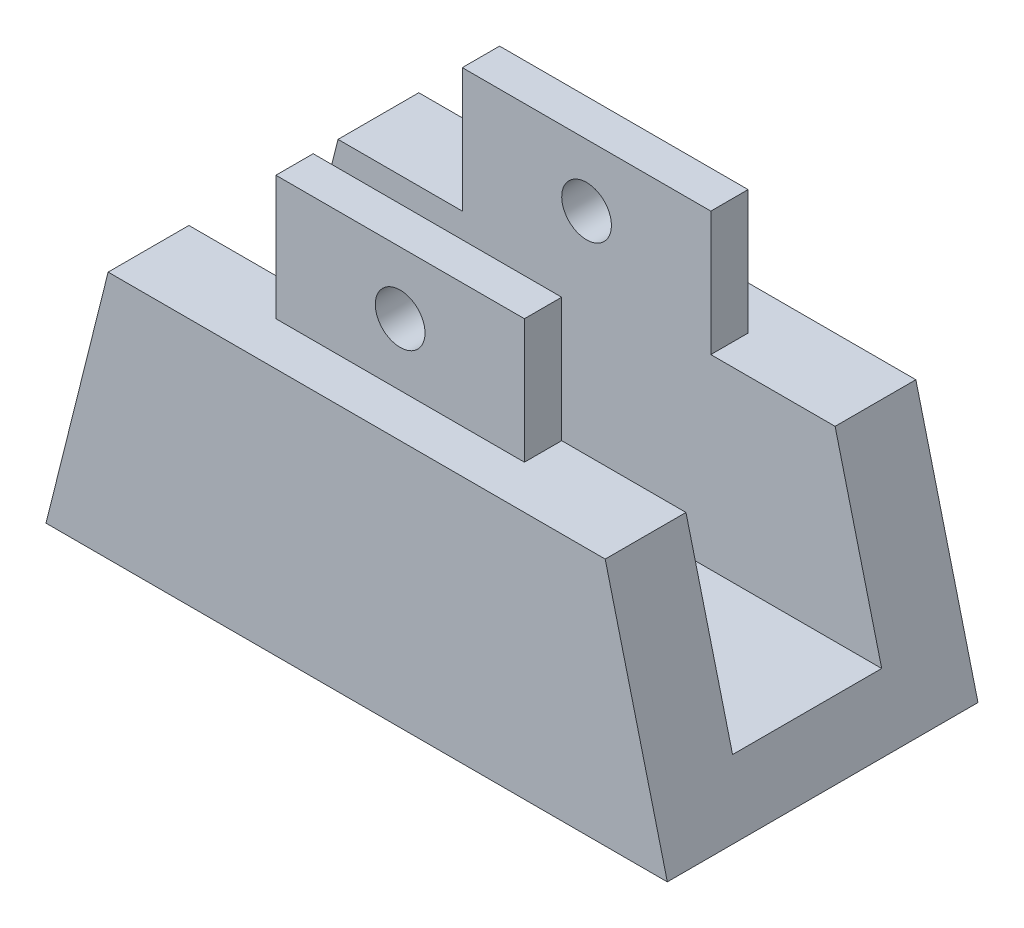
ISO-10303-21;
HEADER;
FILE_DESCRIPTION(('STEP AP214'),'2;1');
FILE_NAME('part.step','',(''),(''),'','','');
FILE_SCHEMA(('AUTOMOTIVE_DESIGN { 1 0 10303 214 1 1 1 1 }'));
ENDSEC;
DATA;
#1=APPLICATION_CONTEXT('core data for automotive mechanical design processes');
#2=APPLICATION_PROTOCOL_DEFINITION('international standard','automotive_design',2000,#1);
#3=PRODUCT_CONTEXT('',#1,'mechanical');
#4=PRODUCT('Part','Part','',(#3));
#5=PRODUCT_RELATED_PRODUCT_CATEGORY('part','',(#4));
#6=PRODUCT_DEFINITION_FORMATION('','',#4);
#7=PRODUCT_DEFINITION_CONTEXT('part definition',#1,'design');
#8=PRODUCT_DEFINITION('design','',#6,#7);
#9=PRODUCT_DEFINITION_SHAPE('','',#8);
#10=(LENGTH_UNIT() NAMED_UNIT(*) SI_UNIT(.MILLI.,.METRE.));
#11=(NAMED_UNIT(*) PLANE_ANGLE_UNIT() SI_UNIT($,.RADIAN.));
#12=(NAMED_UNIT(*) SI_UNIT($,.STERADIAN.) SOLID_ANGLE_UNIT());
#13=UNCERTAINTY_MEASURE_WITH_UNIT(LENGTH_MEASURE(1.E-05),#10,'distance_accuracy_value','');
#14=(GEOMETRIC_REPRESENTATION_CONTEXT(3) GLOBAL_UNCERTAINTY_ASSIGNED_CONTEXT((#13)) GLOBAL_UNIT_ASSIGNED_CONTEXT((#10,
#11,#12)) REPRESENTATION_CONTEXT('',''));
#15=CARTESIAN_POINT('',(0.,0.,0.));
#16=DIRECTION('',(0.,0.,1.));
#17=DIRECTION('',(1.,0.,0.));
#18=AXIS2_PLACEMENT_3D('',#15,#16,#17);
#19=CARTESIAN_POINT('',(-10.,0.,12.5));
#20=DIRECTION('',(0.,-1.,0.));
#21=DIRECTION('',(1.,0.,0.));
#22=AXIS2_PLACEMENT_3D('',#19,#20,#21);
#23=PLANE('',#22);
#24=DIRECTION('',(-1.,0.,0.));
#25=VECTOR('',#24,1.);
#26=CARTESIAN_POINT('',(-10.,0.,-6.));
#27=LINE('',#26,#25);
#28=CARTESIAN_POINT('',(30.,0.,-6.));
#29=VERTEX_POINT('',#28);
#30=CARTESIAN_POINT('',(20.,0.,-6.));
#31=VERTEX_POINT('',#30);
#32=EDGE_CURVE('E173',#29,#31,#27,.T.);
#33=ORIENTED_EDGE('',*,*,#32,.F.);
#34=DIRECTION('',(0.,0.,-1.));
#35=VECTOR('',#34,1.);
#36=CARTESIAN_POINT('',(30.,0.,12.5));
#37=LINE('',#36,#35);
#38=CARTESIAN_POINT('',(30.,0.,-12.5));
#39=VERTEX_POINT('',#38);
#40=EDGE_CURVE('E170',#29,#39,#37,.T.);
#41=ORIENTED_EDGE('',*,*,#40,.T.);
#42=DIRECTION('',(-1.,0.,0.));
#43=VECTOR('',#42,1.);
#44=CARTESIAN_POINT('',(-10.,0.,-12.5));
#45=LINE('',#44,#43);
#46=CARTESIAN_POINT('',(-10.,0.,-12.5));
#47=VERTEX_POINT('',#46);
#48=EDGE_CURVE('E222',#39,#47,#45,.T.);
#49=ORIENTED_EDGE('',*,*,#48,.T.);
#50=DIRECTION('',(0.,0.,-1.));
#51=VECTOR('',#50,1.);
#52=CARTESIAN_POINT('',(-10.,0.,12.5));
#53=LINE('',#52,#51);
#54=CARTESIAN_POINT('',(-10.,0.,-6.));
#55=VERTEX_POINT('',#54);
#56=EDGE_CURVE('E228',#55,#47,#53,.T.);
#57=ORIENTED_EDGE('',*,*,#56,.F.);
#58=DIRECTION('',(-1.,0.,0.));
#59=VECTOR('',#58,1.);
#60=CARTESIAN_POINT('',(-10.,0.,-6.));
#61=LINE('',#60,#59);
#62=CARTESIAN_POINT('',(0.,0.,-6.));
#63=VERTEX_POINT('',#62);
#64=EDGE_CURVE('E181',#63,#55,#61,.T.);
#65=ORIENTED_EDGE('',*,*,#64,.F.);
#66=DIRECTION('',(0.,0.,-1.));
#67=VECTOR('',#66,1.);
#68=CARTESIAN_POINT('',(0.,0.,9.));
#69=LINE('',#68,#67);
#70=CARTESIAN_POINT('',(0.,0.,-9.));
#71=VERTEX_POINT('',#70);
#72=EDGE_CURVE('E266',#63,#71,#69,.T.);
#73=ORIENTED_EDGE('',*,*,#72,.T.);
#74=DIRECTION('',(1.,0.,0.));
#75=VECTOR('',#74,1.);
#76=CARTESIAN_POINT('',(0.,0.,-9.));
#77=LINE('',#76,#75);
#78=CARTESIAN_POINT('',(20.,0.,-9.));
#79=VERTEX_POINT('',#78);
#80=EDGE_CURVE('E262',#71,#79,#77,.T.);
#81=ORIENTED_EDGE('',*,*,#80,.T.);
#82=DIRECTION('',(0.,0.,-1.));
#83=VECTOR('',#82,1.);
#84=CARTESIAN_POINT('',(20.,0.,9.));
#85=LINE('',#84,#83);
#86=EDGE_CURVE('E261',#31,#79,#85,.T.);
#87=ORIENTED_EDGE('',*,*,#86,.F.);
#88=EDGE_LOOP('',(#33,#41,#49,#57,#65,#73,#81,#87));
#89=FACE_BOUND('',#88,.T.);
#90=ADVANCED_FACE('F34',(#89),#23,.F.);
#91=DIRECTION('',(1.,0.,0.));
#92=VECTOR('',#91,1.);
#93=CARTESIAN_POINT('',(-10.,0.,6.));
#94=LINE('',#93,#92);
#95=CARTESIAN_POINT('',(20.,0.,6.));
#96=VERTEX_POINT('',#95);
#97=CARTESIAN_POINT('',(30.,0.,6.));
#98=VERTEX_POINT('',#97);
#99=EDGE_CURVE('E150',#96,#98,#94,.T.);
#100=ORIENTED_EDGE('',*,*,#99,.F.);
#101=DIRECTION('',(0.,0.,-1.));
#102=VECTOR('',#101,1.);
#103=CARTESIAN_POINT('',(20.,0.,9.));
#104=LINE('',#103,#102);
#105=CARTESIAN_POINT('',(20.,0.,9.));
#106=VERTEX_POINT('',#105);
#107=EDGE_CURVE('E49',#106,#96,#104,.T.);
#108=ORIENTED_EDGE('',*,*,#107,.F.);
#109=DIRECTION('',(1.,0.,0.));
#110=VECTOR('',#109,1.);
#111=CARTESIAN_POINT('',(0.,0.,9.));
#112=LINE('',#111,#110);
#113=CARTESIAN_POINT('',(0.,0.,9.));
#114=VERTEX_POINT('',#113);
#115=EDGE_CURVE('E53',#114,#106,#112,.T.);
#116=ORIENTED_EDGE('',*,*,#115,.F.);
#117=DIRECTION('',(0.,0.,-1.));
#118=VECTOR('',#117,1.);
#119=CARTESIAN_POINT('',(0.,0.,9.));
#120=LINE('',#119,#118);
#121=CARTESIAN_POINT('',(0.,0.,6.));
#122=VERTEX_POINT('',#121);
#123=EDGE_CURVE('E213',#114,#122,#120,.T.);
#124=ORIENTED_EDGE('',*,*,#123,.T.);
#125=DIRECTION('',(-1.,0.,0.));
#126=VECTOR('',#125,1.);
#127=CARTESIAN_POINT('',(-10.,0.,6.));
#128=LINE('',#127,#126);
#129=CARTESIAN_POINT('',(-10.,0.,6.));
#130=VERTEX_POINT('',#129);
#131=EDGE_CURVE('E182',#122,#130,#128,.T.);
#132=ORIENTED_EDGE('',*,*,#131,.T.);
#133=CARTESIAN_POINT('',(-10.,0.,12.5));
#134=VERTEX_POINT('',#133);
#135=EDGE_CURVE('E237',#134,#130,#53,.T.);
#136=ORIENTED_EDGE('',*,*,#135,.F.);
#137=DIRECTION('',(-1.,0.,0.));
#138=VECTOR('',#137,1.);
#139=CARTESIAN_POINT('',(-10.,0.,12.5));
#140=LINE('',#139,#138);
#141=CARTESIAN_POINT('',(30.,0.,12.5));
#142=VERTEX_POINT('',#141);
#143=EDGE_CURVE('E226',#142,#134,#140,.T.);
#144=ORIENTED_EDGE('',*,*,#143,.F.);
#145=EDGE_CURVE('E240',#142,#98,#37,.T.);
#146=ORIENTED_EDGE('',*,*,#145,.T.);
#147=EDGE_LOOP('',(#100,#108,#116,#124,#132,#136,#144,#146));
#148=FACE_BOUND('',#147,.T.);
#149=ADVANCED_FACE('F310',(#148),#23,.F.);
#150=CARTESIAN_POINT('',(-10.,0.,12.5));
#151=DIRECTION('',(0.970142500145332,-0.242535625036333,0.));
#152=DIRECTION('',(0.242535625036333,0.970142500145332,0.));
#153=AXIS2_PLACEMENT_3D('',#150,#151,#152);
#154=PLANE('',#153);
#155=DIRECTION('',(0.,0.,1.));
#156=VECTOR('',#155,1.);
#157=CARTESIAN_POINT('',(-13.75,-15.,12.5));
#158=LINE('',#157,#156);
#159=CARTESIAN_POINT('',(-13.75,-15.,-6.));
#160=VERTEX_POINT('',#159);
#161=CARTESIAN_POINT('',(-13.75,-15.,6.));
#162=VERTEX_POINT('',#161);
#163=EDGE_CURVE('E162',#160,#162,#158,.T.);
#164=ORIENTED_EDGE('',*,*,#163,.F.);
#165=DIRECTION('',(-0.242535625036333,-0.970142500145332,0.));
#166=VECTOR('',#165,1.);
#167=CARTESIAN_POINT('',(-12.,-8.,-6.));
#168=LINE('',#167,#166);
#169=EDGE_CURVE('E179',#55,#160,#168,.T.);
#170=ORIENTED_EDGE('',*,*,#169,.F.);
#171=ORIENTED_EDGE('',*,*,#56,.T.);
#172=DIRECTION('',(-0.242535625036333,-0.970142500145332,0.));
#173=VECTOR('',#172,1.);
#174=CARTESIAN_POINT('',(-10.,0.,-12.5));
#175=LINE('',#174,#173);
#176=CARTESIAN_POINT('',(-15.,-20.,-12.5));
#177=VERTEX_POINT('',#176);
#178=EDGE_CURVE('E215',#47,#177,#175,.T.);
#179=ORIENTED_EDGE('',*,*,#178,.T.);
#180=DIRECTION('',(0.,0.,-1.));
#181=VECTOR('',#180,1.);
#182=CARTESIAN_POINT('',(-15.,-20.,12.5));
#183=LINE('',#182,#181);
#184=CARTESIAN_POINT('',(-15.,-20.,12.5));
#185=VERTEX_POINT('',#184);
#186=EDGE_CURVE('E245',#185,#177,#183,.T.);
#187=ORIENTED_EDGE('',*,*,#186,.F.);
#188=DIRECTION('',(-0.242535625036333,-0.970142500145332,0.));
#189=VECTOR('',#188,1.);
#190=CARTESIAN_POINT('',(-10.,0.,12.5));
#191=LINE('',#190,#189);
#192=EDGE_CURVE('E218',#134,#185,#191,.T.);
#193=ORIENTED_EDGE('',*,*,#192,.F.);
#194=ORIENTED_EDGE('',*,*,#135,.T.);
#195=DIRECTION('',(-0.242535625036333,-0.970142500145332,0.));
#196=VECTOR('',#195,1.);
#197=CARTESIAN_POINT('',(-12.,-8.,6.));
#198=LINE('',#197,#196);
#199=EDGE_CURVE('E175',#130,#162,#198,.T.);
#200=ORIENTED_EDGE('',*,*,#199,.T.);
#201=EDGE_LOOP('',(#164,#170,#171,#179,#187,#193,#194,#200));
#202=FACE_BOUND('',#201,.T.);
#203=ADVANCED_FACE('F315',(#202),#154,.F.);
#204=CARTESIAN_POINT('',(35.,-20.,12.5));
#205=DIRECTION('',(-0.970142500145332,-0.242535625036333,0.));
#206=DIRECTION('',(0.242535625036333,-0.970142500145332,0.));
#207=AXIS2_PLACEMENT_3D('',#204,#205,#206);
#208=PLANE('',#207);
#209=DIRECTION('',(-0.242535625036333,0.970142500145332,0.));
#210=VECTOR('',#209,1.);
#211=CARTESIAN_POINT('',(35.,-20.,-6.));
#212=LINE('',#211,#210);
#213=CARTESIAN_POINT('',(33.75,-15.,-6.));
#214=VERTEX_POINT('',#213);
#215=EDGE_CURVE('E168',#214,#29,#212,.T.);
#216=ORIENTED_EDGE('',*,*,#215,.F.);
#217=DIRECTION('',(0.,0.,-1.));
#218=VECTOR('',#217,1.);
#219=CARTESIAN_POINT('',(33.75,-15.,12.5));
#220=LINE('',#219,#218);
#221=CARTESIAN_POINT('',(33.75,-15.,6.));
#222=VERTEX_POINT('',#221);
#223=EDGE_CURVE('E11',#222,#214,#220,.T.);
#224=ORIENTED_EDGE('',*,*,#223,.F.);
#225=DIRECTION('',(0.242535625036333,-0.970142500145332,0.));
#226=VECTOR('',#225,1.);
#227=CARTESIAN_POINT('',(35.,-20.,6.));
#228=LINE('',#227,#226);
#229=EDGE_CURVE('E145',#98,#222,#228,.T.);
#230=ORIENTED_EDGE('',*,*,#229,.F.);
#231=ORIENTED_EDGE('',*,*,#145,.F.);
#232=DIRECTION('',(-0.242535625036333,0.970142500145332,0.));
#233=VECTOR('',#232,1.);
#234=CARTESIAN_POINT('',(35.,-20.,12.5));
#235=LINE('',#234,#233);
#236=CARTESIAN_POINT('',(35.,-20.,12.5));
#237=VERTEX_POINT('',#236);
#238=EDGE_CURVE('E224',#237,#142,#235,.T.);
#239=ORIENTED_EDGE('',*,*,#238,.F.);
#240=DIRECTION('',(0.,0.,-1.));
#241=VECTOR('',#240,1.);
#242=CARTESIAN_POINT('',(35.,-20.,12.5));
#243=LINE('',#242,#241);
#244=CARTESIAN_POINT('',(35.,-20.,-12.5));
#245=VERTEX_POINT('',#244);
#246=EDGE_CURVE('E242',#237,#245,#243,.T.);
#247=ORIENTED_EDGE('',*,*,#246,.T.);
#248=DIRECTION('',(-0.242535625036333,0.970142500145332,0.));
#249=VECTOR('',#248,1.);
#250=CARTESIAN_POINT('',(35.,-20.,-12.5));
#251=LINE('',#250,#249);
#252=EDGE_CURVE('E233',#245,#39,#251,.T.);
#253=ORIENTED_EDGE('',*,*,#252,.T.);
#254=ORIENTED_EDGE('',*,*,#40,.F.);
#255=EDGE_LOOP('',(#216,#224,#230,#231,#239,#247,#253,#254));
#256=FACE_BOUND('',#255,.T.);
#257=ADVANCED_FACE('F166',(#256),#208,.F.);
#258=CARTESIAN_POINT('',(0.,0.,9.));
#259=DIRECTION('',(1.,0.,0.));
#260=DIRECTION('',(0.,0.,-1.));
#261=AXIS2_PLACEMENT_3D('',#258,#259,#260);
#262=PLANE('',#261);
#263=ORIENTED_EDGE('',*,*,#72,.F.);
#264=DIRECTION('',(0.,-1.,0.));
#265=VECTOR('',#264,1.);
#266=CARTESIAN_POINT('',(0.,10.,-6.));
#267=LINE('',#266,#265);
#268=CARTESIAN_POINT('',(0.,10.,-6.));
#269=VERTEX_POINT('',#268);
#270=EDGE_CURVE('E252',#269,#63,#267,.T.);
#271=ORIENTED_EDGE('',*,*,#270,.F.);
#272=DIRECTION('',(0.,0.,-1.));
#273=VECTOR('',#272,1.);
#274=CARTESIAN_POINT('',(0.,10.,9.));
#275=LINE('',#274,#273);
#276=CARTESIAN_POINT('',(0.,10.,-9.));
#277=VERTEX_POINT('',#276);
#278=EDGE_CURVE('E248',#269,#277,#275,.T.);
#279=ORIENTED_EDGE('',*,*,#278,.T.);
#280=DIRECTION('',(0.,-1.,0.));
#281=VECTOR('',#280,1.);
#282=CARTESIAN_POINT('',(0.,0.,-9.));
#283=LINE('',#282,#281);
#284=EDGE_CURVE('E267',#277,#71,#283,.T.);
#285=ORIENTED_EDGE('',*,*,#284,.T.);
#286=EDGE_LOOP('',(#263,#271,#279,#285));
#287=FACE_BOUND('',#286,.T.);
#288=ADVANCED_FACE('F284',(#287),#262,.F.);
#289=CARTESIAN_POINT('',(20.,0.,9.));
#290=DIRECTION('',(-1.,0.,0.));
#291=DIRECTION('',(0.,0.,1.));
#292=AXIS2_PLACEMENT_3D('',#289,#290,#291);
#293=PLANE('',#292);
#294=DIRECTION('',(0.,0.,-1.));
#295=VECTOR('',#294,1.);
#296=CARTESIAN_POINT('',(20.,10.,9.));
#297=LINE('',#296,#295);
#298=CARTESIAN_POINT('',(20.,10.,-6.));
#299=VERTEX_POINT('',#298);
#300=CARTESIAN_POINT('',(20.,10.,-9.));
#301=VERTEX_POINT('',#300);
#302=EDGE_CURVE('E257',#299,#301,#297,.T.);
#303=ORIENTED_EDGE('',*,*,#302,.F.);
#304=DIRECTION('',(0.,-1.,0.));
#305=VECTOR('',#304,1.);
#306=CARTESIAN_POINT('',(20.,10.,-6.));
#307=LINE('',#306,#305);
#308=EDGE_CURVE('E265',#299,#31,#307,.T.);
#309=ORIENTED_EDGE('',*,*,#308,.T.);
#310=ORIENTED_EDGE('',*,*,#86,.T.);
#311=DIRECTION('',(0.,1.,0.));
#312=VECTOR('',#311,1.);
#313=CARTESIAN_POINT('',(20.,0.,-9.));
#314=LINE('',#313,#312);
#315=EDGE_CURVE('E258',#79,#301,#314,.T.);
#316=ORIENTED_EDGE('',*,*,#315,.T.);
#317=EDGE_LOOP('',(#303,#309,#310,#316));
#318=FACE_BOUND('',#317,.T.);
#319=ADVANCED_FACE('F301',(#318),#293,.F.);
#320=CARTESIAN_POINT('',(0.,10.,9.));
#321=DIRECTION('',(0.,-1.,0.));
#322=DIRECTION('',(0.,0.,-1.));
#323=AXIS2_PLACEMENT_3D('',#320,#321,#322);
#324=PLANE('',#323);
#325=ORIENTED_EDGE('',*,*,#278,.F.);
#326=DIRECTION('',(-1.,0.,0.));
#327=VECTOR('',#326,1.);
#328=CARTESIAN_POINT('',(20.,10.,-6.));
#329=LINE('',#328,#327);
#330=EDGE_CURVE('E42',#299,#269,#329,.T.);
#331=ORIENTED_EDGE('',*,*,#330,.F.);
#332=ORIENTED_EDGE('',*,*,#302,.T.);
#333=DIRECTION('',(-1.,0.,0.));
#334=VECTOR('',#333,1.);
#335=CARTESIAN_POINT('',(0.,10.,-9.));
#336=LINE('',#335,#334);
#337=EDGE_CURVE('E254',#301,#277,#336,.T.);
#338=ORIENTED_EDGE('',*,*,#337,.T.);
#339=EDGE_LOOP('',(#325,#331,#332,#338));
#340=FACE_BOUND('',#339,.T.);
#341=ADVANCED_FACE('F289',(#340),#324,.F.);
#342=CARTESIAN_POINT('',(10.,5.,9.));
#343=DIRECTION('',(0.,0.,-1.));
#344=DIRECTION('',(-1.,0.,0.));
#345=AXIS2_PLACEMENT_3D('',#342,#343,#344);
#346=CYLINDRICAL_SURFACE('',#345,2.);
#347=CARTESIAN_POINT('',(10.,5.,-6.));
#348=DIRECTION('',(0.,0.,-1.));
#349=DIRECTION('',(0.,1.,0.));
#350=AXIS2_PLACEMENT_3D('',#347,#348,#349);
#351=CIRCLE('',#350,2.);
#352=CARTESIAN_POINT('',(10.,7.,-6.));
#353=VERTEX_POINT('',#352);
#354=EDGE_CURVE('E249',#353,#353,#351,.T.);
#355=ORIENTED_EDGE('',*,*,#354,.F.);
#356=EDGE_LOOP('',(#355));
#357=FACE_BOUND('',#356,.T.);
#358=CARTESIAN_POINT('',(10.,5.,-9.));
#359=DIRECTION('',(0.,0.,1.));
#360=DIRECTION('',(1.,0.,0.));
#361=AXIS2_PLACEMENT_3D('',#358,#359,#360);
#362=CIRCLE('',#361,2.);
#363=CARTESIAN_POINT('',(12.,5.,-9.));
#364=VERTEX_POINT('',#363);
#365=EDGE_CURVE('E253',#364,#364,#362,.T.);
#366=ORIENTED_EDGE('',*,*,#365,.F.);
#367=EDGE_LOOP('',(#366));
#368=FACE_BOUND('',#367,.T.);
#369=ADVANCED_FACE('F36',(#357,#368),#346,.F.);
#370=CARTESIAN_POINT('',(0.,10.,-9.));
#371=DIRECTION('',(0.,0.,-1.));
#372=DIRECTION('',(-1.,0.,0.));
#373=AXIS2_PLACEMENT_3D('',#370,#371,#372);
#374=PLANE('',#373);
#375=ORIENTED_EDGE('',*,*,#284,.F.);
#376=ORIENTED_EDGE('',*,*,#337,.F.);
#377=ORIENTED_EDGE('',*,*,#315,.F.);
#378=ORIENTED_EDGE('',*,*,#80,.F.);
#379=EDGE_LOOP('',(#375,#376,#377,#378));
#380=FACE_BOUND('',#379,.T.);
#381=ORIENTED_EDGE('',*,*,#365,.T.);
#382=EDGE_LOOP('',(#381));
#383=FACE_BOUND('',#382,.T.);
#384=ADVANCED_FACE('F293',(#380,#383),#374,.T.);
#385=CARTESIAN_POINT('',(20.,10.,-6.));
#386=DIRECTION('',(0.,0.,-1.));
#387=DIRECTION('',(0.,1.,0.));
#388=AXIS2_PLACEMENT_3D('',#385,#386,#387);
#389=PLANE('',#388);
#390=ORIENTED_EDGE('',*,*,#354,.T.);
#391=EDGE_LOOP('',(#390));
#392=FACE_BOUND('',#391,.T.);
#393=ORIENTED_EDGE('',*,*,#270,.T.);
#394=ORIENTED_EDGE('',*,*,#64,.T.);
#395=ORIENTED_EDGE('',*,*,#169,.T.);
#396=DIRECTION('',(-1.,0.,0.));
#397=VECTOR('',#396,1.);
#398=CARTESIAN_POINT('',(35.,-15.,-6.));
#399=LINE('',#398,#397);
#400=EDGE_CURVE('E163',#214,#160,#399,.T.);
#401=ORIENTED_EDGE('',*,*,#400,.F.);
#402=ORIENTED_EDGE('',*,*,#215,.T.);
#403=ORIENTED_EDGE('',*,*,#32,.T.);
#404=ORIENTED_EDGE('',*,*,#308,.F.);
#405=ORIENTED_EDGE('',*,*,#330,.T.);
#406=EDGE_LOOP('',(#393,#394,#395,#401,#402,#403,#404,#405));
#407=FACE_BOUND('',#406,.T.);
#408=ADVANCED_FACE('F298',(#392,#407),#389,.F.);
#409=CARTESIAN_POINT('',(-15.,-20.,12.5));
#410=DIRECTION('',(0.,1.,0.));
#411=DIRECTION('',(-1.,0.,0.));
#412=AXIS2_PLACEMENT_3D('',#409,#410,#411);
#413=PLANE('',#412);
#414=DIRECTION('',(1.,0.,0.));
#415=VECTOR('',#414,1.);
#416=CARTESIAN_POINT('',(-15.,-20.,-12.5));
#417=LINE('',#416,#415);
#418=EDGE_CURVE('E231',#177,#245,#417,.T.);
#419=ORIENTED_EDGE('',*,*,#418,.T.);
#420=ORIENTED_EDGE('',*,*,#246,.F.);
#421=DIRECTION('',(1.,0.,0.));
#422=VECTOR('',#421,1.);
#423=CARTESIAN_POINT('',(-15.,-20.,12.5));
#424=LINE('',#423,#422);
#425=EDGE_CURVE('E221',#185,#237,#424,.T.);
#426=ORIENTED_EDGE('',*,*,#425,.F.);
#427=ORIENTED_EDGE('',*,*,#186,.T.);
#428=EDGE_LOOP('',(#419,#420,#426,#427));
#429=FACE_BOUND('',#428,.T.);
#430=ADVANCED_FACE('F322',(#429),#413,.F.);
#431=CARTESIAN_POINT('',(-15.,-20.,12.5));
#432=DIRECTION('',(0.,0.,1.));
#433=DIRECTION('',(1.,0.,0.));
#434=AXIS2_PLACEMENT_3D('',#431,#432,#433);
#435=PLANE('',#434);
#436=ORIENTED_EDGE('',*,*,#192,.T.);
#437=ORIENTED_EDGE('',*,*,#425,.T.);
#438=ORIENTED_EDGE('',*,*,#238,.T.);
#439=ORIENTED_EDGE('',*,*,#143,.T.);
#440=EDGE_LOOP('',(#436,#437,#438,#439));
#441=FACE_BOUND('',#440,.T.);
#442=ADVANCED_FACE('F325',(#441),#435,.T.);
#443=CARTESIAN_POINT('',(-15.,-20.,-12.5));
#444=DIRECTION('',(0.,0.,1.));
#445=DIRECTION('',(1.,0.,0.));
#446=AXIS2_PLACEMENT_3D('',#443,#444,#445);
#447=PLANE('',#446);
#448=ORIENTED_EDGE('',*,*,#178,.F.);
#449=ORIENTED_EDGE('',*,*,#48,.F.);
#450=ORIENTED_EDGE('',*,*,#252,.F.);
#451=ORIENTED_EDGE('',*,*,#418,.F.);
#452=EDGE_LOOP('',(#448,#449,#450,#451));
#453=FACE_BOUND('',#452,.T.);
#454=ADVANCED_FACE('F318',(#453),#447,.F.);
#455=CARTESIAN_POINT('',(0.,10.,9.));
#456=DIRECTION('',(0.,-1.,0.));
#457=DIRECTION('',(0.,0.,-1.));
#458=AXIS2_PLACEMENT_3D('',#455,#456,#457);
#459=PLANE('',#458);
#460=DIRECTION('',(0.,0.,-1.));
#461=VECTOR('',#460,1.);
#462=CARTESIAN_POINT('',(20.,10.,9.));
#463=LINE('',#462,#461);
#464=CARTESIAN_POINT('',(20.,10.,9.));
#465=VERTEX_POINT('',#464);
#466=CARTESIAN_POINT('',(20.,10.,6.));
#467=VERTEX_POINT('',#466);
#468=EDGE_CURVE('E209',#465,#467,#463,.T.);
#469=ORIENTED_EDGE('',*,*,#468,.T.);
#470=DIRECTION('',(-1.,0.,0.));
#471=VECTOR('',#470,1.);
#472=CARTESIAN_POINT('',(20.,10.,6.));
#473=LINE('',#472,#471);
#474=CARTESIAN_POINT('',(0.,10.,6.));
#475=VERTEX_POINT('',#474);
#476=EDGE_CURVE('E191',#467,#475,#473,.T.);
#477=ORIENTED_EDGE('',*,*,#476,.T.);
#478=DIRECTION('',(0.,0.,-1.));
#479=VECTOR('',#478,1.);
#480=CARTESIAN_POINT('',(0.,10.,9.));
#481=LINE('',#480,#479);
#482=CARTESIAN_POINT('',(0.,10.,9.));
#483=VERTEX_POINT('',#482);
#484=EDGE_CURVE('E206',#483,#475,#481,.T.);
#485=ORIENTED_EDGE('',*,*,#484,.F.);
#486=DIRECTION('',(-1.,0.,0.));
#487=VECTOR('',#486,1.);
#488=CARTESIAN_POINT('',(0.,10.,9.));
#489=LINE('',#488,#487);
#490=EDGE_CURVE('E204',#465,#483,#489,.T.);
#491=ORIENTED_EDGE('',*,*,#490,.F.);
#492=EDGE_LOOP('',(#469,#477,#485,#491));
#493=FACE_BOUND('',#492,.T.);
#494=ADVANCED_FACE('F374',(#493),#459,.F.);
#495=CARTESIAN_POINT('',(20.,0.,9.));
#496=DIRECTION('',(-1.,0.,0.));
#497=DIRECTION('',(0.,0.,1.));
#498=AXIS2_PLACEMENT_3D('',#495,#496,#497);
#499=PLANE('',#498);
#500=ORIENTED_EDGE('',*,*,#107,.T.);
#501=DIRECTION('',(0.,1.,0.));
#502=VECTOR('',#501,1.);
#503=CARTESIAN_POINT('',(20.,10.,6.));
#504=LINE('',#503,#502);
#505=EDGE_CURVE('E188',#96,#467,#504,.T.);
#506=ORIENTED_EDGE('',*,*,#505,.T.);
#507=ORIENTED_EDGE('',*,*,#468,.F.);
#508=DIRECTION('',(0.,1.,0.));
#509=VECTOR('',#508,1.);
#510=CARTESIAN_POINT('',(20.,0.,9.));
#511=LINE('',#510,#509);
#512=EDGE_CURVE('E202',#106,#465,#511,.T.);
#513=ORIENTED_EDGE('',*,*,#512,.F.);
#514=EDGE_LOOP('',(#500,#506,#507,#513));
#515=FACE_BOUND('',#514,.T.);
#516=ADVANCED_FACE('F384',(#515),#499,.F.);
#517=CARTESIAN_POINT('',(0.,0.,9.));
#518=DIRECTION('',(1.,0.,0.));
#519=DIRECTION('',(0.,0.,-1.));
#520=AXIS2_PLACEMENT_3D('',#517,#518,#519);
#521=PLANE('',#520);
#522=ORIENTED_EDGE('',*,*,#484,.T.);
#523=DIRECTION('',(0.,1.,0.));
#524=VECTOR('',#523,1.);
#525=CARTESIAN_POINT('',(0.,10.,6.));
#526=LINE('',#525,#524);
#527=EDGE_CURVE('E184',#122,#475,#526,.T.);
#528=ORIENTED_EDGE('',*,*,#527,.F.);
#529=ORIENTED_EDGE('',*,*,#123,.F.);
#530=DIRECTION('',(0.,-1.,0.));
#531=VECTOR('',#530,1.);
#532=CARTESIAN_POINT('',(0.,0.,9.));
#533=LINE('',#532,#531);
#534=EDGE_CURVE('E199',#483,#114,#533,.T.);
#535=ORIENTED_EDGE('',*,*,#534,.F.);
#536=EDGE_LOOP('',(#522,#528,#529,#535));
#537=FACE_BOUND('',#536,.T.);
#538=ADVANCED_FACE('F398',(#537),#521,.F.);
#539=CARTESIAN_POINT('',(0.,10.,9.));
#540=DIRECTION('',(0.,0.,-1.));
#541=DIRECTION('',(-1.,0.,0.));
#542=AXIS2_PLACEMENT_3D('',#539,#540,#541);
#543=PLANE('',#542);
#544=ORIENTED_EDGE('',*,*,#534,.T.);
#545=ORIENTED_EDGE('',*,*,#115,.T.);
#546=ORIENTED_EDGE('',*,*,#512,.T.);
#547=ORIENTED_EDGE('',*,*,#490,.T.);
#548=EDGE_LOOP('',(#544,#545,#546,#547));
#549=FACE_BOUND('',#548,.T.);
#550=CARTESIAN_POINT('',(10.,5.,9.));
#551=DIRECTION('',(0.,0.,1.));
#552=DIRECTION('',(1.,0.,0.));
#553=AXIS2_PLACEMENT_3D('',#550,#551,#552);
#554=CIRCLE('',#553,2.);
#555=CARTESIAN_POINT('',(12.,5.,9.));
#556=VERTEX_POINT('',#555);
#557=EDGE_CURVE('E196',#556,#556,#554,.T.);
#558=ORIENTED_EDGE('',*,*,#557,.F.);
#559=EDGE_LOOP('',(#558));
#560=FACE_BOUND('',#559,.T.);
#561=ADVANCED_FACE('F392',(#549,#560),#543,.F.);
#562=CARTESIAN_POINT('',(10.,5.,9.));
#563=DIRECTION('',(0.,0.,-1.));
#564=DIRECTION('',(-1.,0.,0.));
#565=AXIS2_PLACEMENT_3D('',#562,#563,#564);
#566=CYLINDRICAL_SURFACE('',#565,2.);
#567=CARTESIAN_POINT('',(10.,5.,6.));
#568=DIRECTION('',(0.,0.,1.));
#569=DIRECTION('',(0.,-1.,0.));
#570=AXIS2_PLACEMENT_3D('',#567,#568,#569);
#571=CIRCLE('',#570,2.);
#572=CARTESIAN_POINT('',(10.,3.,6.));
#573=VERTEX_POINT('',#572);
#574=EDGE_CURVE('E195',#573,#573,#571,.T.);
#575=ORIENTED_EDGE('',*,*,#574,.F.);
#576=EDGE_LOOP('',(#575));
#577=FACE_BOUND('',#576,.T.);
#578=ORIENTED_EDGE('',*,*,#557,.T.);
#579=EDGE_LOOP('',(#578));
#580=FACE_BOUND('',#579,.T.);
#581=ADVANCED_FACE('F397',(#577,#580),#566,.F.);
#582=CARTESIAN_POINT('',(20.,10.,6.));
#583=DIRECTION('',(0.,0.,1.));
#584=DIRECTION('',(0.,-1.,0.));
#585=AXIS2_PLACEMENT_3D('',#582,#583,#584);
#586=PLANE('',#585);
#587=ORIENTED_EDGE('',*,*,#574,.T.);
#588=EDGE_LOOP('',(#587));
#589=FACE_BOUND('',#588,.T.);
#590=ORIENTED_EDGE('',*,*,#527,.T.);
#591=ORIENTED_EDGE('',*,*,#476,.F.);
#592=ORIENTED_EDGE('',*,*,#505,.F.);
#593=ORIENTED_EDGE('',*,*,#99,.T.);
#594=ORIENTED_EDGE('',*,*,#229,.T.);
#595=DIRECTION('',(-1.,0.,0.));
#596=VECTOR('',#595,1.);
#597=CARTESIAN_POINT('',(35.,-15.,6.));
#598=LINE('',#597,#596);
#599=EDGE_CURVE('E148',#222,#162,#598,.T.);
#600=ORIENTED_EDGE('',*,*,#599,.T.);
#601=ORIENTED_EDGE('',*,*,#199,.F.);
#602=ORIENTED_EDGE('',*,*,#131,.F.);
#603=EDGE_LOOP('',(#590,#591,#592,#593,#594,#600,#601,#602));
#604=FACE_BOUND('',#603,.T.);
#605=ADVANCED_FACE('F147',(#589,#604),#586,.F.);
#606=CARTESIAN_POINT('',(35.,-15.,-6.));
#607=DIRECTION('',(0.,1.,0.));
#608=DIRECTION('',(0.,0.,1.));
#609=AXIS2_PLACEMENT_3D('',#606,#607,#608);
#610=PLANE('',#609);
#611=ORIENTED_EDGE('',*,*,#163,.T.);
#612=ORIENTED_EDGE('',*,*,#599,.F.);
#613=ORIENTED_EDGE('',*,*,#223,.T.);
#614=ORIENTED_EDGE('',*,*,#400,.T.);
#615=EDGE_LOOP('',(#611,#612,#613,#614));
#616=FACE_BOUND('',#615,.T.);
#617=ADVANCED_FACE('F158',(#616),#610,.T.);
#618=CLOSED_SHELL('',(#90,#149,#203,#257,#288,#319,#341,#369,#384,#408,#430,#442,#454,#494,#516,
#538,#561,#581,#605,#617));
#619=MANIFOLD_SOLID_BREP('B2',#618);
#620=ADVANCED_BREP_SHAPE_REPRESENTATION('',(#18,#619),#14);
#621=SHAPE_DEFINITION_REPRESENTATION(#9,#620);
ENDSEC;
END-ISO-10303-21;
